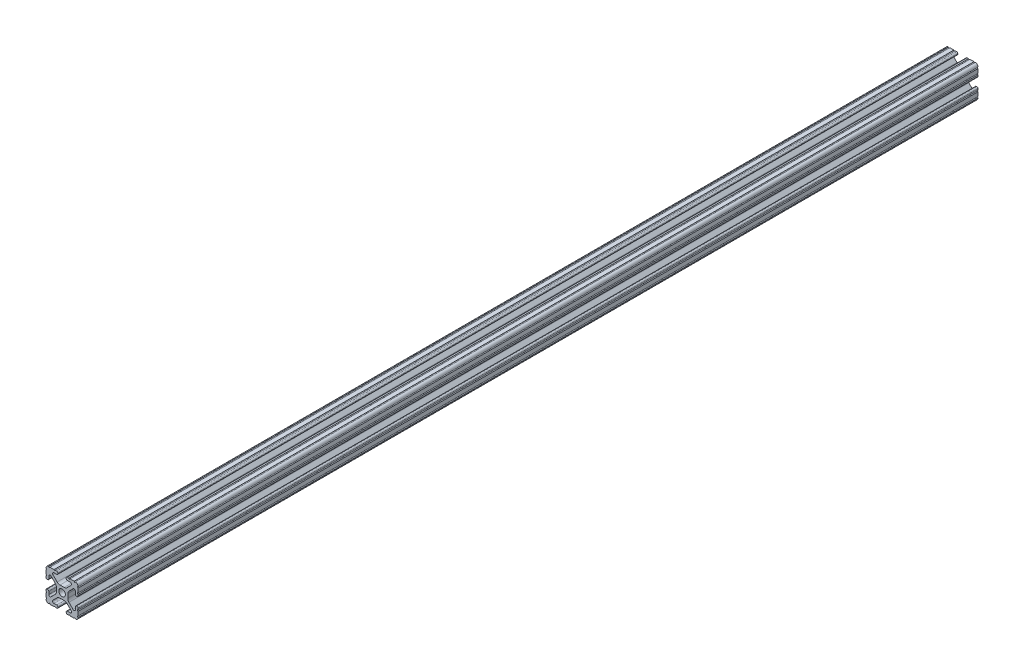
from build123d import *

# Parameters (mm, degrees)
SKETCH1_R      = 2.6035
EXTRUDE1_DEPTH = 711.2


with BuildPart() as part:
    # Sketch1 → Extrude1 (new body)
    with BuildSketch(Plane.XY):
        with BuildLine():
            Line((-7.207036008, 8.724370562), (-3.898272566, 5.423169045))
            ThreePointArc((-3.898272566, 5.423169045), (-2.869120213, 4.736787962), (-1.655778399, 4.4958))
            Line((-1.655778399, 4.4958), (1.655778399, 4.4958))
            ThreePointArc((1.655778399, 4.4958), (2.869120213, 4.736787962), (3.898272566, 5.423169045))
            Line((3.898272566, 5.423169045), (7.207036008, 8.724370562))
            ThreePointArc((7.207036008, 8.724370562), (7.432222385, 9.85140422), (6.476788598, 10.4902))
            Line((6.476788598, 10.4902), (4.287512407, 10.4902))
            ThreePointArc((4.287512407, 10.4902), (3.54574862, 10.79744862), (3.2385, 11.539212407))
            Line((3.2385, 11.539212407), (3.2385, 11.650987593))
            ThreePointArc((3.2385, 11.650987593), (3.54574862, 12.39275138), (4.287512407, 12.7))
            Line((4.287512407, 12.7), (5.317126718, 12.7))
            ThreePointArc((5.317126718, 12.7), (5.825126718, 12.192), (6.333126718, 12.7))
            Line((6.333126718, 12.7), (9.550443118, 12.7))
            ThreePointArc((9.550443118, 12.7), (10.058366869, 12.192000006), (10.566443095, 12.699847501))
            ThreePointArc((10.566443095, 12.699847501), (12.082537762, 12.08250727), (12.699846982, 10.566399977))
            ThreePointArc((12.699846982, 10.566399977), (12.192000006, 10.058323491), (12.7, 9.5504))
            Line((12.7, 9.5504), (12.7, 6.3330836))
            ThreePointArc((12.7, 6.3330836), (12.192, 5.8250836), (12.7, 5.3170836))
            Line((12.7, 5.3170836), (12.7, 4.287469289))
            ThreePointArc((12.7, 4.287469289), (12.39275138, 3.545705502), (11.650987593, 3.238456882))
            Line((11.650987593, 3.238456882), (11.539212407, 3.238456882))
            ThreePointArc((11.539212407, 3.238456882), (10.79744862, 3.545705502), (10.4902, 4.287469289))
            Line((10.4902, 4.287469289), (10.4902, 6.402089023))
            ThreePointArc((10.4902, 6.402089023), (9.856505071, 7.351067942), (8.737131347, 7.129408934))
            Line((8.737131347, 7.129408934), (5.441005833, 3.840816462))
            ThreePointArc((5.441005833, 3.840816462), (4.750877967, 2.809883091), (4.5085, 1.593185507))
            Line((4.5085, 1.593185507), (4.5085, -1.593185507))
            ThreePointArc((4.5085, -1.593185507), (4.750877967, -2.809883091), (5.441005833, -3.840816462))
            Line((5.441005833, -3.840816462), (8.737131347, -7.129408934))
            ThreePointArc((8.737131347, -7.129408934), (9.856505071, -7.351067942), (10.4902, -6.402089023))
            Line((10.4902, -6.402089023), (10.4902, -4.287469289))
            ThreePointArc((10.4902, -4.287469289), (10.79744862, -3.545705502), (11.539212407, -3.238456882))
            Line((11.539212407, -3.238456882), (11.650987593, -3.238456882))
            ThreePointArc((11.650987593, -3.238456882), (12.39275138, -3.545705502), (12.7, -4.287469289))
            Line((12.7, -4.287469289), (12.7, -5.3170836))
            ThreePointArc((12.7, -5.3170836), (12.192, -5.8250836), (12.7, -6.3330836))
            Line((12.7, -6.3330836), (12.7, -9.5504))
            ThreePointArc((12.7, -9.5504), (12.192000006, -10.058323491), (12.699846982, -10.566399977))
            ThreePointArc((12.699846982, -10.566399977), (12.082537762, -12.08250727), (10.566443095, -12.699847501))
            ThreePointArc((10.566443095, -12.699847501), (10.058366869, -12.192000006), (9.550443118, -12.7))
            Line((9.550443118, -12.7), (6.333126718, -12.7))
            ThreePointArc((6.333126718, -12.7), (5.825126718, -12.192), (5.317126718, -12.7))
            Line((5.317126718, -12.7), (4.287512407, -12.7))
            ThreePointArc((4.287512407, -12.7), (3.54574862, -12.39275138), (3.2385, -11.650987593))
            Line((3.2385, -11.650987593), (3.2385, -11.539212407))
            ThreePointArc((3.2385, -11.539212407), (3.54574862, -10.79744862), (4.287512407, -10.4902))
            Line((4.287512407, -10.4902), (6.416408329, -10.4902))
            ThreePointArc((6.416408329, -10.4902), (7.41473083, -9.822813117), (7.179650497, -8.645192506))
            Line((7.179650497, -8.645192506), (3.952270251, -5.423690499))
            ThreePointArc((3.952270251, -5.423690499), (2.922936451, -4.736929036), (1.709253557, -4.4958))
            Line((1.709253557, -4.4958), (-1.709253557, -4.4958))
            ThreePointArc((-1.709253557, -4.4958), (-2.922936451, -4.736929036), (-3.952270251, -5.423690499))
            Line((-3.952270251, -5.423690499), (-7.179650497, -8.645192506))
            ThreePointArc((-7.179650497, -8.645192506), (-7.41473083, -9.822813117), (-6.416408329, -10.4902))
            Line((-6.416408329, -10.4902), (-4.287512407, -10.4902))
            ThreePointArc((-4.287512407, -10.4902), (-3.54574862, -10.79744862), (-3.2385, -11.539212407))
            Line((-3.2385, -11.539212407), (-3.2385, -11.650987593))
            ThreePointArc((-3.2385, -11.650987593), (-3.54574862, -12.39275138), (-4.287512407, -12.7))
            Line((-4.287512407, -12.7), (-5.317126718, -12.7))
            ThreePointArc((-5.317126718, -12.7), (-5.825126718, -12.192), (-6.333126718, -12.7))
            Line((-6.333126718, -12.7), (-9.550443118, -12.7))
            ThreePointArc((-9.550443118, -12.7), (-10.058366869, -12.192000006), (-10.566443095, -12.699847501))
            ThreePointArc((-10.566443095, -12.699847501), (-12.082537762, -12.08250727), (-12.699846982, -10.566399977))
            ThreePointArc((-12.699846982, -10.566399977), (-12.192000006, -10.058323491), (-12.7, -9.5504))
            Line((-12.7, -9.5504), (-12.7, -6.3330836))
            ThreePointArc((-12.7, -6.3330836), (-12.192, -5.8250836), (-12.7, -5.3170836))
            Line((-12.7, -5.3170836), (-12.7, -4.287469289))
            ThreePointArc((-12.7, -4.287469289), (-12.39275138, -3.545705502), (-11.650987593, -3.238456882))
            Line((-11.650987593, -3.238456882), (-11.539212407, -3.238456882))
            ThreePointArc((-11.539212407, -3.238456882), (-10.79744862, -3.545705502), (-10.4902, -4.287469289))
            Line((-10.4902, -4.287469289), (-10.4902, -6.402089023))
            ThreePointArc((-10.4902, -6.402089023), (-9.856505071, -7.351067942), (-8.737131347, -7.129408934))
            Line((-8.737131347, -7.129408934), (-5.441005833, -3.840816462))
            ThreePointArc((-5.441005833, -3.840816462), (-4.750877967, -2.809883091), (-4.5085, -1.593185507))
            Line((-4.5085, -1.593185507), (-4.5085, 1.593185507))
            ThreePointArc((-4.5085, 1.593185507), (-4.750877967, 2.809883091), (-5.441005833, 3.840816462))
            Line((-5.441005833, 3.840816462), (-8.737131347, 7.129408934))
            ThreePointArc((-8.737131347, 7.129408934), (-9.856505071, 7.351067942), (-10.4902, 6.402089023))
            Line((-10.4902, 6.402089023), (-10.4902, 4.287469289))
            ThreePointArc((-10.4902, 4.287469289), (-10.79744862, 3.545705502), (-11.539212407, 3.238456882))
            Line((-11.539212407, 3.238456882), (-11.650987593, 3.238456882))
            ThreePointArc((-11.650987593, 3.238456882), (-12.39275138, 3.545705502), (-12.7, 4.287469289))
            Line((-12.7, 4.287469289), (-12.7, 5.3170836))
            ThreePointArc((-12.7, 5.3170836), (-12.192, 5.8250836), (-12.7, 6.3330836))
            Line((-12.7, 6.3330836), (-12.7, 9.5504))
            ThreePointArc((-12.7, 9.5504), (-12.192000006, 10.058323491), (-12.699846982, 10.566399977))
            ThreePointArc((-12.699846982, 10.566399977), (-12.082537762, 12.08250727), (-10.566443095, 12.699847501))
            ThreePointArc((-10.566443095, 12.699847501), (-10.058366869, 12.192000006), (-9.550443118, 12.7))
            Line((-9.550443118, 12.7), (-6.333126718, 12.7))
            ThreePointArc((-6.333126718, 12.7), (-5.825126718, 12.192), (-5.317126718, 12.7))
            Line((-5.317126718, 12.7), (-4.287512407, 12.7))
            ThreePointArc((-4.287512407, 12.7), (-3.54574862, 12.39275138), (-3.2385, 11.650987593))
            Line((-3.2385, 11.650987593), (-3.2385, 11.539212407))
            ThreePointArc((-3.2385, 11.539212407), (-3.54574862, 10.79744862), (-4.287512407, 10.4902))
            Line((-4.287512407, 10.4902), (-6.476788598, 10.4902))
            ThreePointArc((-6.476788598, 10.4902), (-7.432222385, 9.85140422), (-7.207036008, 8.724370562))
        make_face()
        Circle(SKETCH1_R, mode=Mode.SUBTRACT)
    extrude(amount=-EXTRUDE1_DEPTH)


solid = part.part
